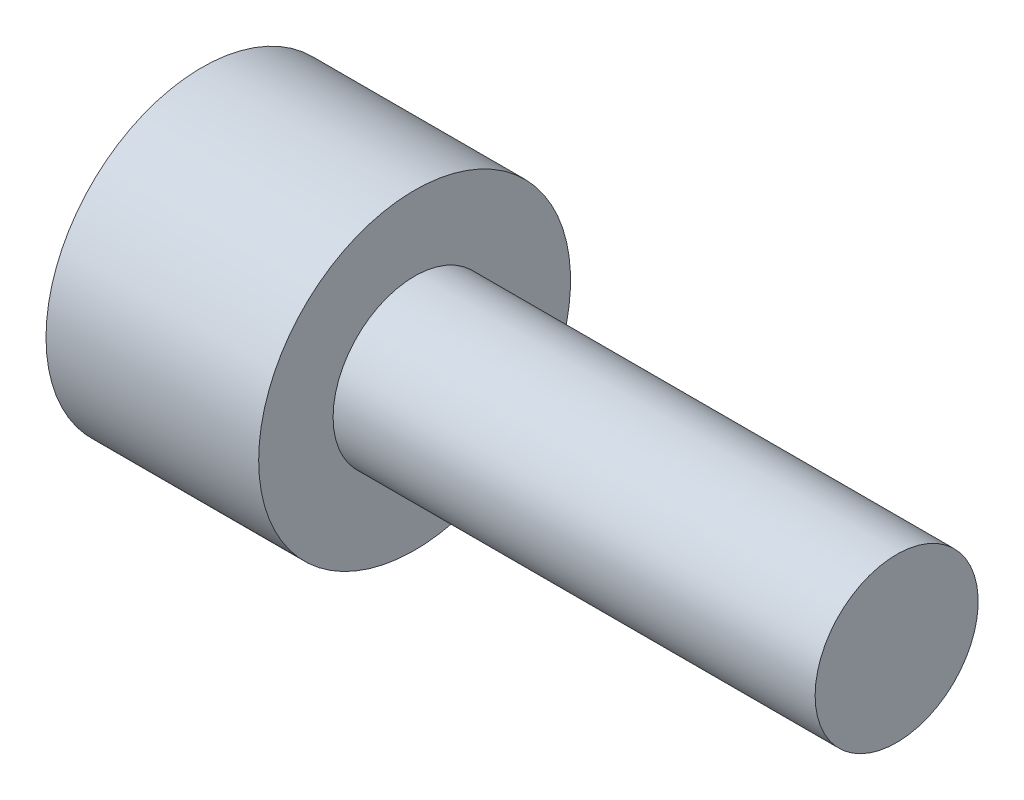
ISO-10303-21;
HEADER;
FILE_DESCRIPTION(('STEP AP214'),'2;1');
FILE_NAME('part.step','',(''),(''),'','','');
FILE_SCHEMA(('AUTOMOTIVE_DESIGN { 1 0 10303 214 1 1 1 1 }'));
ENDSEC;
DATA;
#1=APPLICATION_CONTEXT('core data for automotive mechanical design processes');
#2=APPLICATION_PROTOCOL_DEFINITION('international standard','automotive_design',2000,#1);
#3=PRODUCT_CONTEXT('',#1,'mechanical');
#4=PRODUCT('Part','Part','',(#3));
#5=PRODUCT_RELATED_PRODUCT_CATEGORY('part','',(#4));
#6=PRODUCT_DEFINITION_FORMATION('','',#4);
#7=PRODUCT_DEFINITION_CONTEXT('part definition',#1,'design');
#8=PRODUCT_DEFINITION('design','',#6,#7);
#9=PRODUCT_DEFINITION_SHAPE('','',#8);
#10=(LENGTH_UNIT() NAMED_UNIT(*) SI_UNIT(.MILLI.,.METRE.));
#11=(NAMED_UNIT(*) PLANE_ANGLE_UNIT() SI_UNIT($,.RADIAN.));
#12=(NAMED_UNIT(*) SI_UNIT($,.STERADIAN.) SOLID_ANGLE_UNIT());
#13=UNCERTAINTY_MEASURE_WITH_UNIT(LENGTH_MEASURE(1.E-05),#10,'distance_accuracy_value','');
#14=(GEOMETRIC_REPRESENTATION_CONTEXT(3) GLOBAL_UNCERTAINTY_ASSIGNED_CONTEXT((#13)) GLOBAL_UNIT_ASSIGNED_CONTEXT((#10,
#11,#12)) REPRESENTATION_CONTEXT('',''));
#15=CARTESIAN_POINT('',(0.,0.,0.));
#16=DIRECTION('',(0.,0.,1.));
#17=DIRECTION('',(1.,0.,0.));
#18=AXIS2_PLACEMENT_3D('',#15,#16,#17);
#19=CARTESIAN_POINT('',(0.,0.,0.));
#20=DIRECTION('',(1.,0.,0.));
#21=DIRECTION('',(0.,0.,-1.));
#22=AXIS2_PLACEMENT_3D('',#19,#20,#21);
#23=PLANE('',#22);
#24=CARTESIAN_POINT('',(0.,0.,0.));
#25=DIRECTION('',(-1.,0.,0.));
#26=DIRECTION('',(0.,0.,1.));
#27=AXIS2_PLACEMENT_3D('',#24,#25,#26);
#28=CIRCLE('',#27,0.15);
#29=CARTESIAN_POINT('',(0.,0.,0.15));
#30=VERTEX_POINT('',#29);
#31=EDGE_CURVE('E36',#30,#30,#28,.T.);
#32=ORIENTED_EDGE('',*,*,#31,.F.);
#33=EDGE_LOOP('',(#32));
#34=FACE_BOUND('',#33,.T.);
#35=CARTESIAN_POINT('',(0.,0.,0.));
#36=DIRECTION('',(-1.,0.,0.));
#37=DIRECTION('',(0.,0.,1.));
#38=AXIS2_PLACEMENT_3D('',#35,#36,#37);
#39=CIRCLE('',#38,2.2);
#40=CARTESIAN_POINT('',(0.,0.,2.2));
#41=VERTEX_POINT('',#40);
#42=EDGE_CURVE('E9',#41,#41,#39,.T.);
#43=ORIENTED_EDGE('',*,*,#42,.T.);
#44=EDGE_LOOP('',(#43));
#45=FACE_BOUND('',#44,.T.);
#46=ADVANCED_FACE('F14',(#34,#45),#23,.F.);
#47=CARTESIAN_POINT('',(0.,0.,0.));
#48=DIRECTION('',(-1.,0.,0.));
#49=DIRECTION('',(0.,0.,1.));
#50=AXIS2_PLACEMENT_3D('',#47,#48,#49);
#51=CYLINDRICAL_SURFACE('',#50,2.2);
#52=ORIENTED_EDGE('',*,*,#42,.F.);
#53=EDGE_LOOP('',(#52));
#54=FACE_BOUND('',#53,.T.);
#55=CARTESIAN_POINT('',(3.,0.,0.));
#56=DIRECTION('',(-1.,0.,0.));
#57=DIRECTION('',(0.,0.,1.));
#58=AXIS2_PLACEMENT_3D('',#55,#56,#57);
#59=CIRCLE('',#58,2.2);
#60=CARTESIAN_POINT('',(3.,0.,2.2));
#61=VERTEX_POINT('',#60);
#62=EDGE_CURVE('E20',#61,#61,#59,.T.);
#63=ORIENTED_EDGE('',*,*,#62,.T.);
#64=EDGE_LOOP('',(#63));
#65=FACE_BOUND('',#64,.T.);
#66=ADVANCED_FACE('F43',(#54,#65),#51,.T.);
#67=CARTESIAN_POINT('',(3.,2.2,0.));
#68=DIRECTION('',(-1.,0.,0.));
#69=DIRECTION('',(0.,0.,1.));
#70=AXIS2_PLACEMENT_3D('',#67,#68,#69);
#71=PLANE('',#70);
#72=ORIENTED_EDGE('',*,*,#62,.F.);
#73=EDGE_LOOP('',(#72));
#74=FACE_BOUND('',#73,.T.);
#75=CARTESIAN_POINT('',(3.,0.,0.));
#76=DIRECTION('',(-1.,0.,0.));
#77=DIRECTION('',(0.,0.,1.));
#78=AXIS2_PLACEMENT_3D('',#75,#76,#77);
#79=CIRCLE('',#78,1.15);
#80=CARTESIAN_POINT('',(3.,0.,1.15));
#81=VERTEX_POINT('',#80);
#82=EDGE_CURVE('E24',#81,#81,#79,.T.);
#83=ORIENTED_EDGE('',*,*,#82,.T.);
#84=EDGE_LOOP('',(#83));
#85=FACE_BOUND('',#84,.T.);
#86=ADVANCED_FACE('F49',(#74,#85),#71,.F.);
#87=CARTESIAN_POINT('',(0.,0.,0.));
#88=DIRECTION('',(-1.,0.,0.));
#89=DIRECTION('',(0.,0.,1.));
#90=AXIS2_PLACEMENT_3D('',#87,#88,#89);
#91=CYLINDRICAL_SURFACE('',#90,1.15);
#92=ORIENTED_EDGE('',*,*,#82,.F.);
#93=EDGE_LOOP('',(#92));
#94=FACE_BOUND('',#93,.T.);
#95=CARTESIAN_POINT('',(9.8,0.,0.));
#96=DIRECTION('',(-1.,0.,0.));
#97=DIRECTION('',(0.,0.,1.));
#98=AXIS2_PLACEMENT_3D('',#95,#96,#97);
#99=CIRCLE('',#98,1.15);
#100=CARTESIAN_POINT('',(9.8,0.,1.15));
#101=VERTEX_POINT('',#100);
#102=EDGE_CURVE('E28',#101,#101,#99,.T.);
#103=ORIENTED_EDGE('',*,*,#102,.T.);
#104=EDGE_LOOP('',(#103));
#105=FACE_BOUND('',#104,.T.);
#106=ADVANCED_FACE('F55',(#94,#105),#91,.T.);
#107=CARTESIAN_POINT('',(9.8,1.15,0.));
#108=DIRECTION('',(-1.,0.,0.));
#109=DIRECTION('',(0.,0.,1.));
#110=AXIS2_PLACEMENT_3D('',#107,#108,#109);
#111=PLANE('',#110);
#112=ORIENTED_EDGE('',*,*,#102,.F.);
#113=EDGE_LOOP('',(#112));
#114=FACE_BOUND('',#113,.T.);
#115=ADVANCED_FACE('F61',(#114),#111,.F.);
#116=CARTESIAN_POINT('',(0.,0.,0.));
#117=DIRECTION('',(-1.,0.,0.));
#118=DIRECTION('',(0.,0.,1.));
#119=AXIS2_PLACEMENT_3D('',#116,#117,#118);
#120=CONICAL_SURFACE('',#119,0.15,0.26179938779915);
#121=CARTESIAN_POINT('',(0.3,0.,0.));
#122=DIRECTION('',(-1.,0.,0.));
#123=DIRECTION('',(0.,0.,1.));
#124=AXIS2_PLACEMENT_3D('',#121,#122,#123);
#125=CIRCLE('',#124,0.069615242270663);
#126=CARTESIAN_POINT('',(0.3,0.,0.069615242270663));
#127=VERTEX_POINT('',#126);
#128=EDGE_CURVE('E33',#127,#127,#125,.T.);
#129=ORIENTED_EDGE('',*,*,#128,.F.);
#130=EDGE_LOOP('',(#129));
#131=FACE_BOUND('',#130,.T.);
#132=ORIENTED_EDGE('',*,*,#31,.T.);
#133=EDGE_LOOP('',(#132));
#134=FACE_BOUND('',#133,.T.);
#135=ADVANCED_FACE('F40',(#131,#134),#120,.F.);
#136=CARTESIAN_POINT('',(0.3,0.,0.));
#137=DIRECTION('',(-1.,0.,0.));
#138=DIRECTION('',(0.,0.,1.));
#139=AXIS2_PLACEMENT_3D('',#136,#137,#138);
#140=PLANE('',#139);
#141=ORIENTED_EDGE('',*,*,#128,.T.);
#142=EDGE_LOOP('',(#141));
#143=FACE_BOUND('',#142,.T.);
#144=ADVANCED_FACE('F68',(#143),#140,.T.);
#145=CLOSED_SHELL('',(#46,#66,#86,#106,#115,#135,#144));
#146=MANIFOLD_SOLID_BREP('B1',#145);
#147=ADVANCED_BREP_SHAPE_REPRESENTATION('',(#18,#146),#14);
#148=SHAPE_DEFINITION_REPRESENTATION(#9,#147);
ENDSEC;
END-ISO-10303-21;
